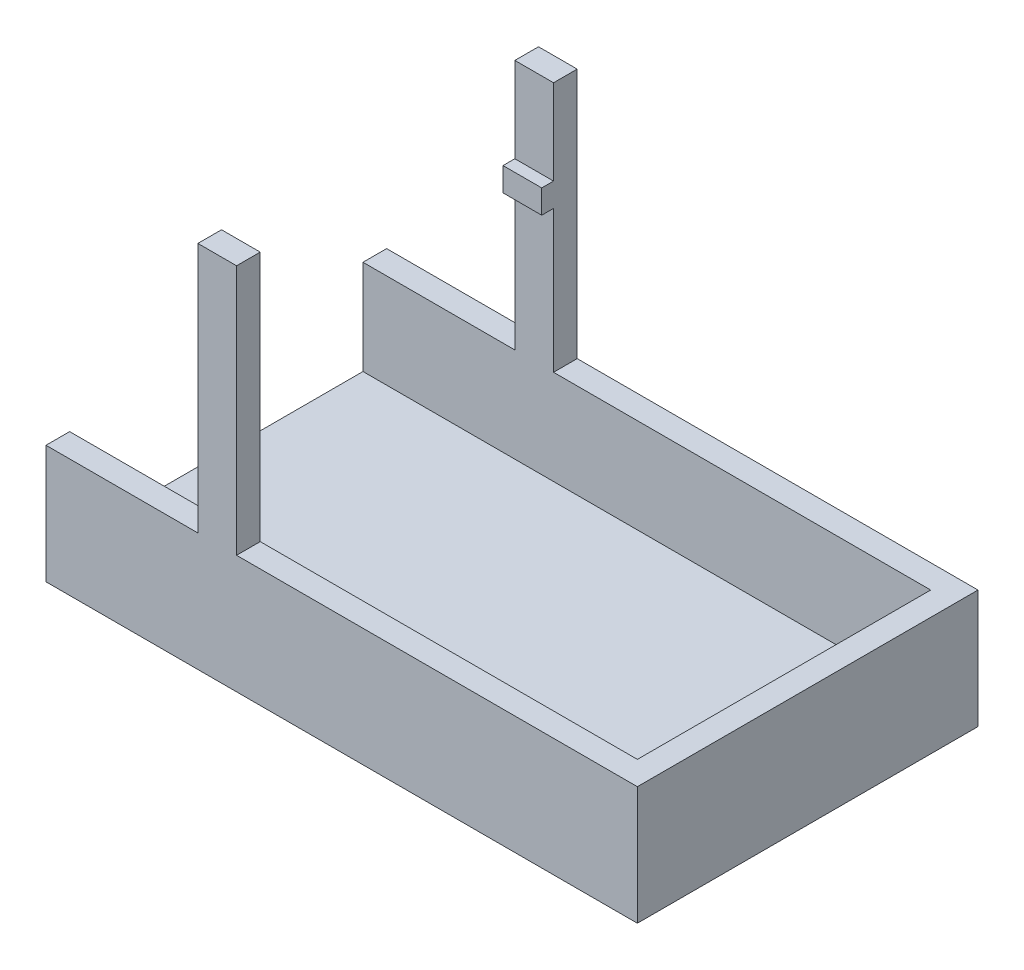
ISO-10303-21;
HEADER;
FILE_DESCRIPTION(('STEP AP214'),'2;1');
FILE_NAME('part.step','',(''),(''),'','','');
FILE_SCHEMA(('AUTOMOTIVE_DESIGN { 1 0 10303 214 1 1 1 1 }'));
ENDSEC;
DATA;
#1=APPLICATION_CONTEXT('core data for automotive mechanical design processes');
#2=APPLICATION_PROTOCOL_DEFINITION('international standard','automotive_design',2000,#1);
#3=PRODUCT_CONTEXT('',#1,'mechanical');
#4=PRODUCT('Part','Part','',(#3));
#5=PRODUCT_RELATED_PRODUCT_CATEGORY('part','',(#4));
#6=PRODUCT_DEFINITION_FORMATION('','',#4);
#7=PRODUCT_DEFINITION_CONTEXT('part definition',#1,'design');
#8=PRODUCT_DEFINITION('design','',#6,#7);
#9=PRODUCT_DEFINITION_SHAPE('','',#8);
#10=(LENGTH_UNIT() NAMED_UNIT(*) SI_UNIT(.MILLI.,.METRE.));
#11=(NAMED_UNIT(*) PLANE_ANGLE_UNIT() SI_UNIT($,.RADIAN.));
#12=(NAMED_UNIT(*) SI_UNIT($,.STERADIAN.) SOLID_ANGLE_UNIT());
#13=UNCERTAINTY_MEASURE_WITH_UNIT(LENGTH_MEASURE(1.E-05),#10,'distance_accuracy_value','');
#14=(GEOMETRIC_REPRESENTATION_CONTEXT(3) GLOBAL_UNCERTAINTY_ASSIGNED_CONTEXT((#13)) GLOBAL_UNIT_ASSIGNED_CONTEXT((#10,
#11,#12)) REPRESENTATION_CONTEXT('',''));
#15=CARTESIAN_POINT('',(0.,0.,0.));
#16=DIRECTION('',(0.,0.,1.));
#17=DIRECTION('',(1.,0.,0.));
#18=AXIS2_PLACEMENT_3D('',#15,#16,#17);
#19=CARTESIAN_POINT('',(0.,50.,-62.));
#20=DIRECTION('',(0.,0.,-1.));
#21=DIRECTION('',(-1.,0.,0.));
#22=AXIS2_PLACEMENT_3D('',#19,#20,#21);
#23=PLANE('',#22);
#24=DIRECTION('',(1.,0.,0.));
#25=VECTOR('',#24,1.);
#26=CARTESIAN_POINT('',(64.2012494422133,110.,-62.));
#27=LINE('',#26,#25);
#28=CARTESIAN_POINT('',(64.2012494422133,110.,-62.));
#29=VERTEX_POINT('',#28);
#30=CARTESIAN_POINT('',(80.5629927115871,110.,-62.));
#31=VERTEX_POINT('',#30);
#32=EDGE_CURVE('E176',#29,#31,#27,.T.);
#33=ORIENTED_EDGE('',*,*,#32,.F.);
#34=DIRECTION('',(0.,-1.,0.));
#35=VECTOR('',#34,1.);
#36=CARTESIAN_POINT('',(64.2012494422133,156.,-62.));
#37=LINE('',#36,#35);
#38=CARTESIAN_POINT('',(64.2012494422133,50.,-62.));
#39=VERTEX_POINT('',#38);
#40=EDGE_CURVE('E165',#29,#39,#37,.T.);
#41=ORIENTED_EDGE('',*,*,#40,.T.);
#42=DIRECTION('',(-1.,0.,0.));
#43=VECTOR('',#42,1.);
#44=CARTESIAN_POINT('',(0.,50.,-62.));
#45=LINE('',#44,#43);
#46=CARTESIAN_POINT('',(0.,50.,-62.));
#47=VERTEX_POINT('',#46);
#48=EDGE_CURVE('E252',#39,#47,#45,.T.);
#49=ORIENTED_EDGE('',*,*,#48,.T.);
#50=DIRECTION('',(0.,-1.,0.));
#51=VECTOR('',#50,1.);
#52=CARTESIAN_POINT('',(0.,50.,-62.));
#53=LINE('',#52,#51);
#54=CARTESIAN_POINT('',(0.,10.,-62.));
#55=VERTEX_POINT('',#54);
#56=EDGE_CURVE('E241',#47,#55,#53,.T.);
#57=ORIENTED_EDGE('',*,*,#56,.T.);
#58=DIRECTION('',(1.,0.,0.));
#59=VECTOR('',#58,1.);
#60=CARTESIAN_POINT('',(0.,10.,-62.));
#61=LINE('',#60,#59);
#62=CARTESIAN_POINT('',(240.,10.,-62.));
#63=VERTEX_POINT('',#62);
#64=EDGE_CURVE('E238',#55,#63,#61,.T.);
#65=ORIENTED_EDGE('',*,*,#64,.T.);
#66=DIRECTION('',(0.,1.,0.));
#67=VECTOR('',#66,1.);
#68=CARTESIAN_POINT('',(240.,50.,-62.));
#69=LINE('',#68,#67);
#70=CARTESIAN_POINT('',(240.,50.,-62.));
#71=VERTEX_POINT('',#70);
#72=EDGE_CURVE('E240',#63,#71,#69,.T.);
#73=ORIENTED_EDGE('',*,*,#72,.T.);
#74=CARTESIAN_POINT('',(80.5629927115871,50.,-62.));
#75=VERTEX_POINT('',#74);
#76=EDGE_CURVE('E261',#71,#75,#45,.T.);
#77=ORIENTED_EDGE('',*,*,#76,.T.);
#78=DIRECTION('',(0.,-1.,0.));
#79=VECTOR('',#78,1.);
#80=CARTESIAN_POINT('',(80.5629927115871,156.,-62.));
#81=LINE('',#80,#79);
#82=EDGE_CURVE('E41',#31,#75,#81,.T.);
#83=ORIENTED_EDGE('',*,*,#82,.F.);
#84=EDGE_LOOP('',(#33,#41,#49,#57,#65,#73,#77,#83));
#85=FACE_BOUND('',#84,.T.);
#86=ADVANCED_FACE('F24',(#85),#23,.F.);
#87=DIRECTION('',(-1.,0.,0.));
#88=VECTOR('',#87,1.);
#89=CARTESIAN_POINT('',(64.2012494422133,120.,-62.));
#90=LINE('',#89,#88);
#91=CARTESIAN_POINT('',(80.5629927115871,120.,-62.));
#92=VERTEX_POINT('',#91);
#93=CARTESIAN_POINT('',(64.2012494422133,120.,-62.));
#94=VERTEX_POINT('',#93);
#95=EDGE_CURVE('E49',#92,#94,#90,.T.);
#96=ORIENTED_EDGE('',*,*,#95,.F.);
#97=CARTESIAN_POINT('',(80.5629927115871,156.,-62.));
#98=VERTEX_POINT('',#97);
#99=EDGE_CURVE('E174',#98,#92,#81,.T.);
#100=ORIENTED_EDGE('',*,*,#99,.F.);
#101=DIRECTION('',(1.,0.,0.));
#102=VECTOR('',#101,1.);
#103=CARTESIAN_POINT('',(80.5629927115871,156.,-62.));
#104=LINE('',#103,#102);
#105=CARTESIAN_POINT('',(64.2012494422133,156.,-62.));
#106=VERTEX_POINT('',#105);
#107=EDGE_CURVE('E201',#106,#98,#104,.T.);
#108=ORIENTED_EDGE('',*,*,#107,.F.);
#109=EDGE_CURVE('E173',#106,#94,#37,.T.);
#110=ORIENTED_EDGE('',*,*,#109,.T.);
#111=EDGE_LOOP('',(#96,#100,#108,#110));
#112=FACE_BOUND('',#111,.T.);
#113=ADVANCED_FACE('F347',(#112),#23,.F.);
#114=CARTESIAN_POINT('',(250.,50.,72.));
#115=DIRECTION('',(0.,-1.,0.));
#116=DIRECTION('',(1.,0.,0.));
#117=AXIS2_PLACEMENT_3D('',#114,#115,#116);
#118=PLANE('',#117);
#119=DIRECTION('',(0.,0.,-1.));
#120=VECTOR('',#119,1.);
#121=CARTESIAN_POINT('',(80.5629927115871,50.,-72.));
#122=LINE('',#121,#120);
#123=CARTESIAN_POINT('',(80.5629927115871,50.,-72.));
#124=VERTEX_POINT('',#123);
#125=EDGE_CURVE('E184',#75,#124,#122,.T.);
#126=ORIENTED_EDGE('',*,*,#125,.F.);
#127=ORIENTED_EDGE('',*,*,#76,.F.);
#128=DIRECTION('',(0.,0.,-1.));
#129=VECTOR('',#128,1.);
#130=CARTESIAN_POINT('',(240.,50.,72.));
#131=LINE('',#130,#129);
#132=CARTESIAN_POINT('',(240.,50.,62.));
#133=VERTEX_POINT('',#132);
#134=EDGE_CURVE('E246',#133,#71,#131,.T.);
#135=ORIENTED_EDGE('',*,*,#134,.F.);
#136=DIRECTION('',(-1.,0.,0.));
#137=VECTOR('',#136,1.);
#138=CARTESIAN_POINT('',(0.,50.,62.));
#139=LINE('',#138,#137);
#140=CARTESIAN_POINT('',(80.5629927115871,50.,62.));
#141=VERTEX_POINT('',#140);
#142=EDGE_CURVE('E269',#133,#141,#139,.T.);
#143=ORIENTED_EDGE('',*,*,#142,.T.);
#144=DIRECTION('',(0.,0.,-1.));
#145=VECTOR('',#144,1.);
#146=CARTESIAN_POINT('',(80.5629927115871,50.,72.));
#147=LINE('',#146,#145);
#148=CARTESIAN_POINT('',(80.5629927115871,50.,72.));
#149=VERTEX_POINT('',#148);
#150=EDGE_CURVE('E208',#149,#141,#147,.T.);
#151=ORIENTED_EDGE('',*,*,#150,.F.);
#152=DIRECTION('',(-1.,0.,0.));
#153=VECTOR('',#152,1.);
#154=CARTESIAN_POINT('',(250.,50.,72.));
#155=LINE('',#154,#153);
#156=CARTESIAN_POINT('',(250.,50.,72.));
#157=VERTEX_POINT('',#156);
#158=EDGE_CURVE('E288',#157,#149,#155,.T.);
#159=ORIENTED_EDGE('',*,*,#158,.F.);
#160=DIRECTION('',(0.,0.,-1.));
#161=VECTOR('',#160,1.);
#162=CARTESIAN_POINT('',(250.,50.,72.));
#163=LINE('',#162,#161);
#164=CARTESIAN_POINT('',(250.,50.,-72.));
#165=VERTEX_POINT('',#164);
#166=EDGE_CURVE('E273',#157,#165,#163,.T.);
#167=ORIENTED_EDGE('',*,*,#166,.T.);
#168=DIRECTION('',(-1.,0.,0.));
#169=VECTOR('',#168,1.);
#170=CARTESIAN_POINT('',(250.,50.,-72.));
#171=LINE('',#170,#169);
#172=EDGE_CURVE('E300',#165,#124,#171,.T.);
#173=ORIENTED_EDGE('',*,*,#172,.T.);
#174=EDGE_LOOP('',(#126,#127,#135,#143,#151,#159,#167,#173));
#175=FACE_BOUND('',#174,.T.);
#176=ADVANCED_FACE('F353',(#175),#118,.F.);
#177=DIRECTION('',(0.,0.,1.));
#178=VECTOR('',#177,1.);
#179=CARTESIAN_POINT('',(64.2012494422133,50.,-72.));
#180=LINE('',#179,#178);
#181=CARTESIAN_POINT('',(64.2012494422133,50.,-72.));
#182=VERTEX_POINT('',#181);
#183=EDGE_CURVE('E171',#182,#39,#180,.T.);
#184=ORIENTED_EDGE('',*,*,#183,.F.);
#185=CARTESIAN_POINT('',(0.,50.,-72.));
#186=VERTEX_POINT('',#185);
#187=EDGE_CURVE('E305',#182,#186,#171,.T.);
#188=ORIENTED_EDGE('',*,*,#187,.T.);
#189=DIRECTION('',(0.,0.,-1.));
#190=VECTOR('',#189,1.);
#191=CARTESIAN_POINT('',(0.,50.,72.));
#192=LINE('',#191,#190);
#193=EDGE_CURVE('E279',#47,#186,#192,.T.);
#194=ORIENTED_EDGE('',*,*,#193,.F.);
#195=ORIENTED_EDGE('',*,*,#48,.F.);
#196=EDGE_LOOP('',(#184,#188,#194,#195));
#197=FACE_BOUND('',#196,.T.);
#198=ADVANCED_FACE('F321',(#197),#118,.F.);
#199=DIRECTION('',(0.,0.,1.));
#200=VECTOR('',#199,1.);
#201=CARTESIAN_POINT('',(64.2012494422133,50.,72.));
#202=LINE('',#201,#200);
#203=CARTESIAN_POINT('',(64.2012494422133,50.,62.));
#204=VERTEX_POINT('',#203);
#205=CARTESIAN_POINT('',(64.2012494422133,50.,72.));
#206=VERTEX_POINT('',#205);
#207=EDGE_CURVE('E216',#204,#206,#202,.T.);
#208=ORIENTED_EDGE('',*,*,#207,.F.);
#209=CARTESIAN_POINT('',(0.,50.,62.));
#210=VERTEX_POINT('',#209);
#211=EDGE_CURVE('E255',#204,#210,#139,.T.);
#212=ORIENTED_EDGE('',*,*,#211,.T.);
#213=CARTESIAN_POINT('',(0.,50.,72.));
#214=VERTEX_POINT('',#213);
#215=EDGE_CURVE('E276',#214,#210,#192,.T.);
#216=ORIENTED_EDGE('',*,*,#215,.F.);
#217=EDGE_CURVE('E286',#206,#214,#155,.T.);
#218=ORIENTED_EDGE('',*,*,#217,.F.);
#219=EDGE_LOOP('',(#208,#212,#216,#218));
#220=FACE_BOUND('',#219,.T.);
#221=ADVANCED_FACE('F436',(#220),#118,.F.);
#222=CARTESIAN_POINT('',(0.,50.,72.));
#223=DIRECTION('',(1.,0.,0.));
#224=DIRECTION('',(0.,1.,0.));
#225=AXIS2_PLACEMENT_3D('',#222,#223,#224);
#226=PLANE('',#225);
#227=ORIENTED_EDGE('',*,*,#56,.F.);
#228=ORIENTED_EDGE('',*,*,#193,.T.);
#229=DIRECTION('',(0.,-1.,0.));
#230=VECTOR('',#229,1.);
#231=CARTESIAN_POINT('',(0.,50.,-72.));
#232=LINE('',#231,#230);
#233=CARTESIAN_POINT('',(0.,0.,-72.));
#234=VERTEX_POINT('',#233);
#235=EDGE_CURVE('E258',#186,#234,#232,.T.);
#236=ORIENTED_EDGE('',*,*,#235,.T.);
#237=DIRECTION('',(0.,0.,-1.));
#238=VECTOR('',#237,1.);
#239=CARTESIAN_POINT('',(0.,0.,72.));
#240=LINE('',#239,#238);
#241=CARTESIAN_POINT('',(0.,0.,72.));
#242=VERTEX_POINT('',#241);
#243=EDGE_CURVE('E11',#242,#234,#240,.T.);
#244=ORIENTED_EDGE('',*,*,#243,.F.);
#245=DIRECTION('',(0.,-1.,0.));
#246=VECTOR('',#245,1.);
#247=CARTESIAN_POINT('',(0.,50.,72.));
#248=LINE('',#247,#246);
#249=EDGE_CURVE('E298',#214,#242,#248,.T.);
#250=ORIENTED_EDGE('',*,*,#249,.F.);
#251=ORIENTED_EDGE('',*,*,#215,.T.);
#252=DIRECTION('',(0.,-1.,0.));
#253=VECTOR('',#252,1.);
#254=CARTESIAN_POINT('',(0.,50.,62.));
#255=LINE('',#254,#253);
#256=CARTESIAN_POINT('',(0.,10.,62.));
#257=VERTEX_POINT('',#256);
#258=EDGE_CURVE('E250',#210,#257,#255,.T.);
#259=ORIENTED_EDGE('',*,*,#258,.T.);
#260=DIRECTION('',(0.,0.,-1.));
#261=VECTOR('',#260,1.);
#262=CARTESIAN_POINT('',(0.,10.,72.));
#263=LINE('',#262,#261);
#264=EDGE_CURVE('E245',#257,#55,#263,.T.);
#265=ORIENTED_EDGE('',*,*,#264,.T.);
#266=EDGE_LOOP('',(#227,#228,#236,#244,#250,#251,#259,#265));
#267=FACE_BOUND('',#266,.T.);
#268=ADVANCED_FACE('F26',(#267),#226,.F.);
#269=CARTESIAN_POINT('',(0.,0.,72.));
#270=DIRECTION('',(0.,1.,0.));
#271=DIRECTION('',(0.,0.,1.));
#272=AXIS2_PLACEMENT_3D('',#269,#270,#271);
#273=PLANE('',#272);
#274=DIRECTION('',(1.,0.,0.));
#275=VECTOR('',#274,1.);
#276=CARTESIAN_POINT('',(0.,0.,-72.));
#277=LINE('',#276,#275);
#278=CARTESIAN_POINT('',(250.,0.,-72.));
#279=VERTEX_POINT('',#278);
#280=EDGE_CURVE('E308',#234,#279,#277,.T.);
#281=ORIENTED_EDGE('',*,*,#280,.T.);
#282=DIRECTION('',(0.,0.,-1.));
#283=VECTOR('',#282,1.);
#284=CARTESIAN_POINT('',(250.,0.,72.));
#285=LINE('',#284,#283);
#286=CARTESIAN_POINT('',(250.,0.,72.));
#287=VERTEX_POINT('',#286);
#288=EDGE_CURVE('E33',#287,#279,#285,.T.);
#289=ORIENTED_EDGE('',*,*,#288,.F.);
#290=DIRECTION('',(1.,0.,0.));
#291=VECTOR('',#290,1.);
#292=CARTESIAN_POINT('',(0.,0.,72.));
#293=LINE('',#292,#291);
#294=EDGE_CURVE('E295',#242,#287,#293,.T.);
#295=ORIENTED_EDGE('',*,*,#294,.F.);
#296=ORIENTED_EDGE('',*,*,#243,.T.);
#297=EDGE_LOOP('',(#281,#289,#295,#296));
#298=FACE_BOUND('',#297,.T.);
#299=ADVANCED_FACE('F331',(#298),#273,.F.);
#300=CARTESIAN_POINT('',(250.,0.,72.));
#301=DIRECTION('',(-1.,0.,0.));
#302=DIRECTION('',(0.,0.,1.));
#303=AXIS2_PLACEMENT_3D('',#300,#301,#302);
#304=PLANE('',#303);
#305=DIRECTION('',(0.,1.,0.));
#306=VECTOR('',#305,1.);
#307=CARTESIAN_POINT('',(250.,0.,-72.));
#308=LINE('',#307,#306);
#309=EDGE_CURVE('E306',#279,#165,#308,.T.);
#310=ORIENTED_EDGE('',*,*,#309,.T.);
#311=ORIENTED_EDGE('',*,*,#166,.F.);
#312=DIRECTION('',(0.,1.,0.));
#313=VECTOR('',#312,1.);
#314=CARTESIAN_POINT('',(250.,0.,72.));
#315=LINE('',#314,#313);
#316=EDGE_CURVE('E282',#287,#157,#315,.T.);
#317=ORIENTED_EDGE('',*,*,#316,.F.);
#318=ORIENTED_EDGE('',*,*,#288,.T.);
#319=EDGE_LOOP('',(#310,#311,#317,#318));
#320=FACE_BOUND('',#319,.T.);
#321=ADVANCED_FACE('F334',(#320),#304,.F.);
#322=CARTESIAN_POINT('',(0.,50.,72.));
#323=DIRECTION('',(0.,0.,-1.));
#324=DIRECTION('',(-1.,0.,0.));
#325=AXIS2_PLACEMENT_3D('',#322,#323,#324);
#326=PLANE('',#325);
#327=ORIENTED_EDGE('',*,*,#249,.T.);
#328=ORIENTED_EDGE('',*,*,#294,.T.);
#329=ORIENTED_EDGE('',*,*,#316,.T.);
#330=ORIENTED_EDGE('',*,*,#158,.T.);
#331=DIRECTION('',(0.,-1.,0.));
#332=VECTOR('',#331,1.);
#333=CARTESIAN_POINT('',(80.5629927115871,156.,72.));
#334=LINE('',#333,#332);
#335=CARTESIAN_POINT('',(80.5629927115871,156.,72.));
#336=VERTEX_POINT('',#335);
#337=EDGE_CURVE('E219',#336,#149,#334,.T.);
#338=ORIENTED_EDGE('',*,*,#337,.F.);
#339=DIRECTION('',(1.,0.,0.));
#340=VECTOR('',#339,1.);
#341=CARTESIAN_POINT('',(80.5629927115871,156.,72.));
#342=LINE('',#341,#340);
#343=CARTESIAN_POINT('',(64.2012494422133,156.,72.));
#344=VERTEX_POINT('',#343);
#345=EDGE_CURVE('E222',#344,#336,#342,.T.);
#346=ORIENTED_EDGE('',*,*,#345,.F.);
#347=DIRECTION('',(0.,-1.,0.));
#348=VECTOR('',#347,1.);
#349=CARTESIAN_POINT('',(64.2012494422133,156.,72.));
#350=LINE('',#349,#348);
#351=EDGE_CURVE('E221',#344,#206,#350,.T.);
#352=ORIENTED_EDGE('',*,*,#351,.T.);
#353=ORIENTED_EDGE('',*,*,#217,.T.);
#354=EDGE_LOOP('',(#327,#328,#329,#330,#338,#346,#352,#353));
#355=FACE_BOUND('',#354,.T.);
#356=ADVANCED_FACE('F332',(#355),#326,.F.);
#357=CARTESIAN_POINT('',(0.,50.,-72.));
#358=DIRECTION('',(0.,0.,-1.));
#359=DIRECTION('',(-1.,0.,0.));
#360=AXIS2_PLACEMENT_3D('',#357,#358,#359);
#361=PLANE('',#360);
#362=ORIENTED_EDGE('',*,*,#235,.F.);
#363=ORIENTED_EDGE('',*,*,#187,.F.);
#364=DIRECTION('',(0.,-1.,0.));
#365=VECTOR('',#364,1.);
#366=CARTESIAN_POINT('',(64.2012494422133,156.,-72.));
#367=LINE('',#366,#365);
#368=CARTESIAN_POINT('',(64.2012494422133,156.,-72.));
#369=VERTEX_POINT('',#368);
#370=EDGE_CURVE('E204',#369,#182,#367,.T.);
#371=ORIENTED_EDGE('',*,*,#370,.F.);
#372=DIRECTION('',(-1.,0.,0.));
#373=VECTOR('',#372,1.);
#374=CARTESIAN_POINT('',(80.5629927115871,156.,-72.));
#375=LINE('',#374,#373);
#376=CARTESIAN_POINT('',(80.5629927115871,156.,-72.));
#377=VERTEX_POINT('',#376);
#378=EDGE_CURVE('E197',#377,#369,#375,.T.);
#379=ORIENTED_EDGE('',*,*,#378,.F.);
#380=DIRECTION('',(0.,-1.,0.));
#381=VECTOR('',#380,1.);
#382=CARTESIAN_POINT('',(80.5629927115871,156.,-72.));
#383=LINE('',#382,#381);
#384=EDGE_CURVE('E206',#377,#124,#383,.T.);
#385=ORIENTED_EDGE('',*,*,#384,.T.);
#386=ORIENTED_EDGE('',*,*,#172,.F.);
#387=ORIENTED_EDGE('',*,*,#309,.F.);
#388=ORIENTED_EDGE('',*,*,#280,.F.);
#389=EDGE_LOOP('',(#362,#363,#371,#379,#385,#386,#387,#388));
#390=FACE_BOUND('',#389,.T.);
#391=ADVANCED_FACE('F325',(#390),#361,.T.);
#392=CARTESIAN_POINT('',(0.,10.,72.));
#393=DIRECTION('',(0.,1.,0.));
#394=DIRECTION('',(0.,0.,1.));
#395=AXIS2_PLACEMENT_3D('',#392,#393,#394);
#396=PLANE('',#395);
#397=ORIENTED_EDGE('',*,*,#64,.F.);
#398=ORIENTED_EDGE('',*,*,#264,.F.);
#399=DIRECTION('',(1.,0.,0.));
#400=VECTOR('',#399,1.);
#401=CARTESIAN_POINT('',(0.,10.,62.));
#402=LINE('',#401,#400);
#403=CARTESIAN_POINT('',(240.,10.,62.));
#404=VERTEX_POINT('',#403);
#405=EDGE_CURVE('E247',#257,#404,#402,.T.);
#406=ORIENTED_EDGE('',*,*,#405,.T.);
#407=DIRECTION('',(0.,0.,-1.));
#408=VECTOR('',#407,1.);
#409=CARTESIAN_POINT('',(240.,10.,72.));
#410=LINE('',#409,#408);
#411=EDGE_CURVE('E242',#404,#63,#410,.T.);
#412=ORIENTED_EDGE('',*,*,#411,.T.);
#413=EDGE_LOOP('',(#397,#398,#406,#412));
#414=FACE_BOUND('',#413,.T.);
#415=ADVANCED_FACE('F340',(#414),#396,.T.);
#416=CARTESIAN_POINT('',(240.,0.,72.));
#417=DIRECTION('',(-1.,0.,0.));
#418=DIRECTION('',(0.,0.,1.));
#419=AXIS2_PLACEMENT_3D('',#416,#417,#418);
#420=PLANE('',#419);
#421=ORIENTED_EDGE('',*,*,#72,.F.);
#422=ORIENTED_EDGE('',*,*,#411,.F.);
#423=DIRECTION('',(0.,1.,0.));
#424=VECTOR('',#423,1.);
#425=CARTESIAN_POINT('',(240.,50.,62.));
#426=LINE('',#425,#424);
#427=EDGE_CURVE('E249',#404,#133,#426,.T.);
#428=ORIENTED_EDGE('',*,*,#427,.T.);
#429=ORIENTED_EDGE('',*,*,#134,.T.);
#430=EDGE_LOOP('',(#421,#422,#428,#429));
#431=FACE_BOUND('',#430,.T.);
#432=ADVANCED_FACE('F359',(#431),#420,.T.);
#433=CARTESIAN_POINT('',(0.,50.,62.));
#434=DIRECTION('',(0.,0.,-1.));
#435=DIRECTION('',(-1.,0.,0.));
#436=AXIS2_PLACEMENT_3D('',#433,#434,#435);
#437=PLANE('',#436);
#438=ORIENTED_EDGE('',*,*,#258,.F.);
#439=ORIENTED_EDGE('',*,*,#211,.F.);
#440=DIRECTION('',(0.,-1.,0.));
#441=VECTOR('',#440,1.);
#442=CARTESIAN_POINT('',(64.2012494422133,156.,62.));
#443=LINE('',#442,#441);
#444=CARTESIAN_POINT('',(64.2012494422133,156.,62.));
#445=VERTEX_POINT('',#444);
#446=EDGE_CURVE('E227',#445,#204,#443,.T.);
#447=ORIENTED_EDGE('',*,*,#446,.F.);
#448=DIRECTION('',(-1.,0.,0.));
#449=VECTOR('',#448,1.);
#450=CARTESIAN_POINT('',(80.5629927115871,156.,62.));
#451=LINE('',#450,#449);
#452=CARTESIAN_POINT('',(80.5629927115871,156.,62.));
#453=VERTEX_POINT('',#452);
#454=EDGE_CURVE('E234',#453,#445,#451,.T.);
#455=ORIENTED_EDGE('',*,*,#454,.F.);
#456=DIRECTION('',(0.,-1.,0.));
#457=VECTOR('',#456,1.);
#458=CARTESIAN_POINT('',(80.5629927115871,156.,62.));
#459=LINE('',#458,#457);
#460=EDGE_CURVE('E313',#453,#141,#459,.T.);
#461=ORIENTED_EDGE('',*,*,#460,.T.);
#462=ORIENTED_EDGE('',*,*,#142,.F.);
#463=ORIENTED_EDGE('',*,*,#427,.F.);
#464=ORIENTED_EDGE('',*,*,#405,.F.);
#465=EDGE_LOOP('',(#438,#439,#447,#455,#461,#462,#463,#464));
#466=FACE_BOUND('',#465,.T.);
#467=ADVANCED_FACE('F355',(#466),#437,.T.);
#468=CARTESIAN_POINT('',(80.5629927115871,156.,72.));
#469=DIRECTION('',(-1.,0.,0.));
#470=DIRECTION('',(0.,-1.,0.));
#471=AXIS2_PLACEMENT_3D('',#468,#469,#470);
#472=PLANE('',#471);
#473=ORIENTED_EDGE('',*,*,#150,.T.);
#474=ORIENTED_EDGE('',*,*,#460,.F.);
#475=DIRECTION('',(0.,0.,-1.));
#476=VECTOR('',#475,1.);
#477=CARTESIAN_POINT('',(80.5629927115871,156.,72.));
#478=LINE('',#477,#476);
#479=EDGE_CURVE('E422',#336,#453,#478,.T.);
#480=ORIENTED_EDGE('',*,*,#479,.F.);
#481=ORIENTED_EDGE('',*,*,#337,.T.);
#482=EDGE_LOOP('',(#473,#474,#480,#481));
#483=FACE_BOUND('',#482,.T.);
#484=ADVANCED_FACE('F358',(#483),#472,.F.);
#485=CARTESIAN_POINT('',(64.2012494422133,156.,72.));
#486=DIRECTION('',(1.,0.,0.));
#487=DIRECTION('',(0.,1.,0.));
#488=AXIS2_PLACEMENT_3D('',#485,#486,#487);
#489=PLANE('',#488);
#490=ORIENTED_EDGE('',*,*,#207,.T.);
#491=ORIENTED_EDGE('',*,*,#351,.F.);
#492=DIRECTION('',(0.,0.,1.));
#493=VECTOR('',#492,1.);
#494=CARTESIAN_POINT('',(64.2012494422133,156.,72.));
#495=LINE('',#494,#493);
#496=EDGE_CURVE('E229',#445,#344,#495,.T.);
#497=ORIENTED_EDGE('',*,*,#496,.F.);
#498=ORIENTED_EDGE('',*,*,#446,.T.);
#499=EDGE_LOOP('',(#490,#491,#497,#498));
#500=FACE_BOUND('',#499,.T.);
#501=ADVANCED_FACE('F369',(#500),#489,.F.);
#502=CARTESIAN_POINT('',(80.5629927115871,156.,62.));
#503=DIRECTION('',(0.,1.,0.));
#504=DIRECTION('',(-1.,0.,0.));
#505=AXIS2_PLACEMENT_3D('',#502,#503,#504);
#506=PLANE('',#505);
#507=ORIENTED_EDGE('',*,*,#479,.T.);
#508=ORIENTED_EDGE('',*,*,#454,.T.);
#509=ORIENTED_EDGE('',*,*,#496,.T.);
#510=ORIENTED_EDGE('',*,*,#345,.T.);
#511=EDGE_LOOP('',(#507,#508,#509,#510));
#512=FACE_BOUND('',#511,.T.);
#513=ADVANCED_FACE('F372',(#512),#506,.T.);
#514=CARTESIAN_POINT('',(80.5629927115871,156.,-72.));
#515=DIRECTION('',(-1.,0.,0.));
#516=DIRECTION('',(0.,-1.,0.));
#517=AXIS2_PLACEMENT_3D('',#514,#515,#516);
#518=PLANE('',#517);
#519=ORIENTED_EDGE('',*,*,#125,.T.);
#520=ORIENTED_EDGE('',*,*,#384,.F.);
#521=DIRECTION('',(0.,0.,-1.));
#522=VECTOR('',#521,1.);
#523=CARTESIAN_POINT('',(80.5629927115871,156.,-72.));
#524=LINE('',#523,#522);
#525=EDGE_CURVE('E194',#98,#377,#524,.T.);
#526=ORIENTED_EDGE('',*,*,#525,.F.);
#527=ORIENTED_EDGE('',*,*,#99,.T.);
#528=DIRECTION('',(0.,0.,-1.));
#529=VECTOR('',#528,1.);
#530=CARTESIAN_POINT('',(80.5629927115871,120.,-57.));
#531=LINE('',#530,#529);
#532=CARTESIAN_POINT('',(80.5629927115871,120.,-57.));
#533=VERTEX_POINT('',#532);
#534=EDGE_CURVE('E189',#533,#92,#531,.T.);
#535=ORIENTED_EDGE('',*,*,#534,.F.);
#536=DIRECTION('',(0.,1.,0.));
#537=VECTOR('',#536,1.);
#538=CARTESIAN_POINT('',(80.5629927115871,120.,-57.));
#539=LINE('',#538,#537);
#540=CARTESIAN_POINT('',(80.5629927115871,110.,-57.));
#541=VERTEX_POINT('',#540);
#542=EDGE_CURVE('E402',#541,#533,#539,.T.);
#543=ORIENTED_EDGE('',*,*,#542,.F.);
#544=DIRECTION('',(0.,0.,-1.));
#545=VECTOR('',#544,1.);
#546=CARTESIAN_POINT('',(80.5629927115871,110.,-57.));
#547=LINE('',#546,#545);
#548=EDGE_CURVE('E185',#541,#31,#547,.T.);
#549=ORIENTED_EDGE('',*,*,#548,.T.);
#550=ORIENTED_EDGE('',*,*,#82,.T.);
#551=EDGE_LOOP('',(#519,#520,#526,#527,#535,#543,#549,#550));
#552=FACE_BOUND('',#551,.T.);
#553=ADVANCED_FACE('F376',(#552),#518,.F.);
#554=CARTESIAN_POINT('',(64.2012494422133,156.,-72.));
#555=DIRECTION('',(1.,0.,0.));
#556=DIRECTION('',(0.,1.,0.));
#557=AXIS2_PLACEMENT_3D('',#554,#555,#556);
#558=PLANE('',#557);
#559=ORIENTED_EDGE('',*,*,#183,.T.);
#560=ORIENTED_EDGE('',*,*,#40,.F.);
#561=DIRECTION('',(0.,0.,-1.));
#562=VECTOR('',#561,1.);
#563=CARTESIAN_POINT('',(64.2012494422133,110.,-57.));
#564=LINE('',#563,#562);
#565=CARTESIAN_POINT('',(64.2012494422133,110.,-57.));
#566=VERTEX_POINT('',#565);
#567=EDGE_CURVE('E169',#566,#29,#564,.T.);
#568=ORIENTED_EDGE('',*,*,#567,.F.);
#569=DIRECTION('',(0.,-1.,0.));
#570=VECTOR('',#569,1.);
#571=CARTESIAN_POINT('',(64.2012494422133,120.,-57.));
#572=LINE('',#571,#570);
#573=CARTESIAN_POINT('',(64.2012494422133,120.,-57.));
#574=VERTEX_POINT('',#573);
#575=EDGE_CURVE('E396',#574,#566,#572,.T.);
#576=ORIENTED_EDGE('',*,*,#575,.F.);
#577=DIRECTION('',(0.,0.,-1.));
#578=VECTOR('',#577,1.);
#579=CARTESIAN_POINT('',(64.2012494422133,120.,-57.));
#580=LINE('',#579,#578);
#581=EDGE_CURVE('E408',#574,#94,#580,.T.);
#582=ORIENTED_EDGE('',*,*,#581,.T.);
#583=ORIENTED_EDGE('',*,*,#109,.F.);
#584=DIRECTION('',(0.,0.,1.));
#585=VECTOR('',#584,1.);
#586=CARTESIAN_POINT('',(64.2012494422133,156.,-72.));
#587=LINE('',#586,#585);
#588=EDGE_CURVE('E199',#369,#106,#587,.T.);
#589=ORIENTED_EDGE('',*,*,#588,.F.);
#590=ORIENTED_EDGE('',*,*,#370,.T.);
#591=EDGE_LOOP('',(#559,#560,#568,#576,#582,#583,#589,#590));
#592=FACE_BOUND('',#591,.T.);
#593=ADVANCED_FACE('F166',(#592),#558,.F.);
#594=CARTESIAN_POINT('',(80.5629927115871,156.,-62.));
#595=DIRECTION('',(0.,-1.,0.));
#596=DIRECTION('',(1.,0.,0.));
#597=AXIS2_PLACEMENT_3D('',#594,#595,#596);
#598=PLANE('',#597);
#599=ORIENTED_EDGE('',*,*,#525,.T.);
#600=ORIENTED_EDGE('',*,*,#378,.T.);
#601=ORIENTED_EDGE('',*,*,#588,.T.);
#602=ORIENTED_EDGE('',*,*,#107,.T.);
#603=EDGE_LOOP('',(#599,#600,#601,#602));
#604=FACE_BOUND('',#603,.T.);
#605=ADVANCED_FACE('F382',(#604),#598,.F.);
#606=CARTESIAN_POINT('',(64.2012494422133,110.,-57.));
#607=DIRECTION('',(0.,1.,0.));
#608=DIRECTION('',(0.,0.,1.));
#609=AXIS2_PLACEMENT_3D('',#606,#607,#608);
#610=PLANE('',#609);
#611=ORIENTED_EDGE('',*,*,#32,.T.);
#612=ORIENTED_EDGE('',*,*,#548,.F.);
#613=DIRECTION('',(1.,0.,0.));
#614=VECTOR('',#613,1.);
#615=CARTESIAN_POINT('',(64.2012494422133,110.,-57.));
#616=LINE('',#615,#614);
#617=EDGE_CURVE('E182',#566,#541,#616,.T.);
#618=ORIENTED_EDGE('',*,*,#617,.F.);
#619=ORIENTED_EDGE('',*,*,#567,.T.);
#620=EDGE_LOOP('',(#611,#612,#618,#619));
#621=FACE_BOUND('',#620,.T.);
#622=ADVANCED_FACE('F181',(#621),#610,.F.);
#623=CARTESIAN_POINT('',(64.2012494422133,120.,-57.));
#624=DIRECTION('',(0.,-1.,0.));
#625=DIRECTION('',(0.,0.,-1.));
#626=AXIS2_PLACEMENT_3D('',#623,#624,#625);
#627=PLANE('',#626);
#628=ORIENTED_EDGE('',*,*,#95,.T.);
#629=ORIENTED_EDGE('',*,*,#581,.F.);
#630=DIRECTION('',(-1.,0.,0.));
#631=VECTOR('',#630,1.);
#632=CARTESIAN_POINT('',(64.2012494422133,120.,-57.));
#633=LINE('',#632,#631);
#634=EDGE_CURVE('E398',#533,#574,#633,.T.);
#635=ORIENTED_EDGE('',*,*,#634,.F.);
#636=ORIENTED_EDGE('',*,*,#534,.T.);
#637=EDGE_LOOP('',(#628,#629,#635,#636));
#638=FACE_BOUND('',#637,.T.);
#639=ADVANCED_FACE('F387',(#638),#627,.F.);
#640=CARTESIAN_POINT('',(64.2012494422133,110.,-57.));
#641=DIRECTION('',(0.,0.,1.));
#642=DIRECTION('',(1.,0.,0.));
#643=AXIS2_PLACEMENT_3D('',#640,#641,#642);
#644=PLANE('',#643);
#645=ORIENTED_EDGE('',*,*,#575,.T.);
#646=ORIENTED_EDGE('',*,*,#617,.T.);
#647=ORIENTED_EDGE('',*,*,#542,.T.);
#648=ORIENTED_EDGE('',*,*,#634,.T.);
#649=EDGE_LOOP('',(#645,#646,#647,#648));
#650=FACE_BOUND('',#649,.T.);
#651=ADVANCED_FACE('F390',(#650),#644,.T.);
#652=CLOSED_SHELL('',(#86,#113,#176,#198,#221,#268,#299,#321,#356,#391,#415,#432,#467,#484,#501,
#513,#553,#593,#605,#622,#639,#651));
#653=MANIFOLD_SOLID_BREP('B2',#652);
#654=ADVANCED_BREP_SHAPE_REPRESENTATION('',(#18,#653),#14);
#655=SHAPE_DEFINITION_REPRESENTATION(#9,#654);
ENDSEC;
END-ISO-10303-21;
